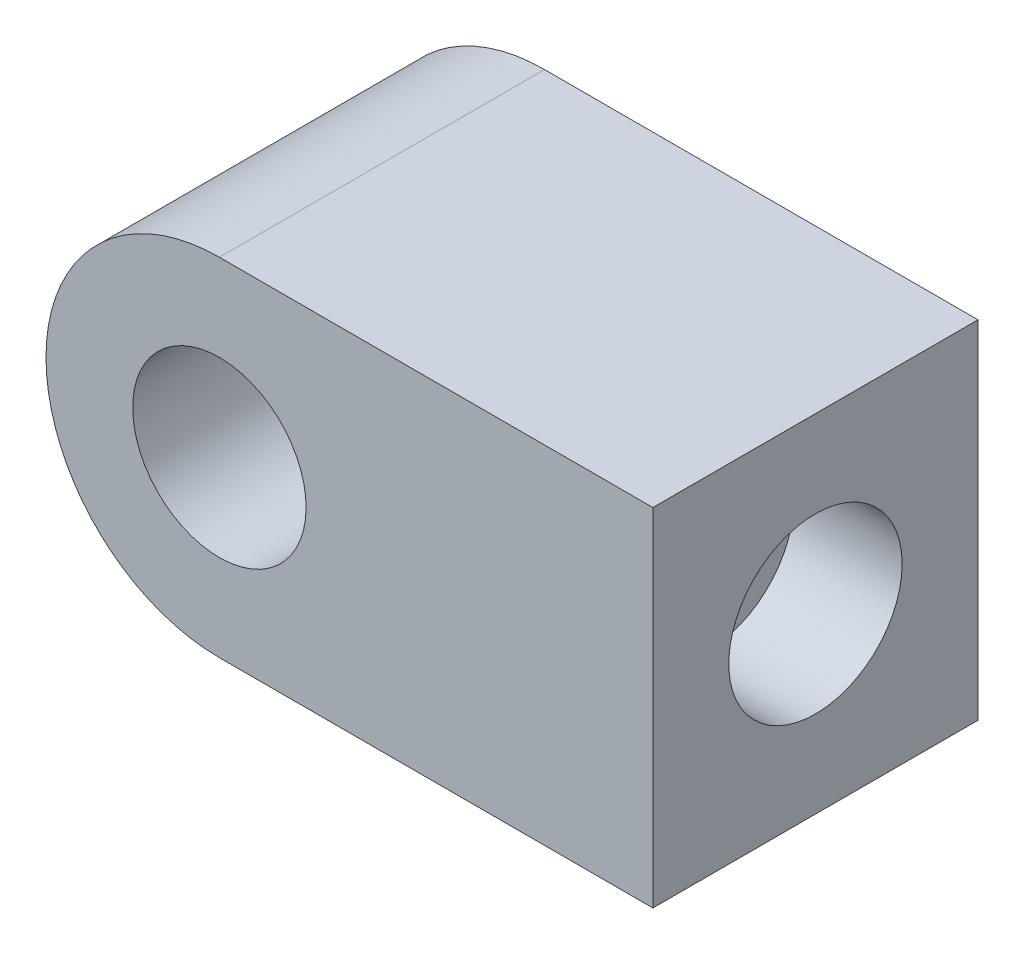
ISO-10303-21;
HEADER;
FILE_DESCRIPTION(('STEP AP214'),'2;1');
FILE_NAME('part.step','',(''),(''),'','','');
FILE_SCHEMA(('AUTOMOTIVE_DESIGN { 1 0 10303 214 1 1 1 1 }'));
ENDSEC;
DATA;
#1=APPLICATION_CONTEXT('core data for automotive mechanical design processes');
#2=APPLICATION_PROTOCOL_DEFINITION('international standard','automotive_design',2000,#1);
#3=PRODUCT_CONTEXT('',#1,'mechanical');
#4=PRODUCT('Part','Part','',(#3));
#5=PRODUCT_RELATED_PRODUCT_CATEGORY('part','',(#4));
#6=PRODUCT_DEFINITION_FORMATION('','',#4);
#7=PRODUCT_DEFINITION_CONTEXT('part definition',#1,'design');
#8=PRODUCT_DEFINITION('design','',#6,#7);
#9=PRODUCT_DEFINITION_SHAPE('','',#8);
#10=(LENGTH_UNIT() NAMED_UNIT(*) SI_UNIT(.MILLI.,.METRE.));
#11=(NAMED_UNIT(*) PLANE_ANGLE_UNIT() SI_UNIT($,.RADIAN.));
#12=(NAMED_UNIT(*) SI_UNIT($,.STERADIAN.) SOLID_ANGLE_UNIT());
#13=UNCERTAINTY_MEASURE_WITH_UNIT(LENGTH_MEASURE(1.E-05),#10,'distance_accuracy_value','');
#14=(GEOMETRIC_REPRESENTATION_CONTEXT(3) GLOBAL_UNCERTAINTY_ASSIGNED_CONTEXT((#13)) GLOBAL_UNIT_ASSIGNED_CONTEXT((#10,
#11,#12)) REPRESENTATION_CONTEXT('',''));
#15=CARTESIAN_POINT('',(0.,0.,0.));
#16=DIRECTION('',(0.,0.,1.));
#17=DIRECTION('',(1.,0.,0.));
#18=AXIS2_PLACEMENT_3D('',#15,#16,#17);
#19=CARTESIAN_POINT('',(0.,0.,15.));
#20=DIRECTION('',(0.,0.,1.));
#21=DIRECTION('',(1.,0.,0.));
#22=AXIS2_PLACEMENT_3D('',#19,#20,#21);
#23=PLANE('',#22);
#24=CARTESIAN_POINT('',(0.,0.,15.));
#25=DIRECTION('',(0.,0.,1.));
#26=DIRECTION('',(1.,0.,0.));
#27=AXIS2_PLACEMENT_3D('',#24,#25,#26);
#28=CIRCLE('',#27,8.);
#29=CARTESIAN_POINT('',(0.,8.,15.));
#30=VERTEX_POINT('',#29);
#31=CARTESIAN_POINT('',(0.,-8.,15.));
#32=VERTEX_POINT('',#31);
#33=EDGE_CURVE('E94',#30,#32,#28,.T.);
#34=ORIENTED_EDGE('',*,*,#33,.T.);
#35=DIRECTION('',(1.,0.,0.));
#36=VECTOR('',#35,1.);
#37=CARTESIAN_POINT('',(20.,-8.,15.));
#38=LINE('',#37,#36);
#39=CARTESIAN_POINT('',(20.,-8.,15.));
#40=VERTEX_POINT('',#39);
#41=EDGE_CURVE('E89',#32,#40,#38,.T.);
#42=ORIENTED_EDGE('',*,*,#41,.T.);
#43=DIRECTION('',(0.,1.,0.));
#44=VECTOR('',#43,1.);
#45=CARTESIAN_POINT('',(20.,8.,15.));
#46=LINE('',#45,#44);
#47=CARTESIAN_POINT('',(20.,8.,15.));
#48=VERTEX_POINT('',#47);
#49=EDGE_CURVE('E92',#40,#48,#46,.T.);
#50=ORIENTED_EDGE('',*,*,#49,.T.);
#51=DIRECTION('',(-1.,0.,0.));
#52=VECTOR('',#51,1.);
#53=CARTESIAN_POINT('',(0.,8.,15.));
#54=LINE('',#53,#52);
#55=EDGE_CURVE('E59',#48,#30,#54,.T.);
#56=ORIENTED_EDGE('',*,*,#55,.T.);
#57=EDGE_LOOP('',(#34,#42,#50,#56));
#58=FACE_BOUND('',#57,.T.);
#59=CARTESIAN_POINT('',(0.,0.,15.));
#60=DIRECTION('',(0.,0.,1.));
#61=DIRECTION('',(1.,0.,0.));
#62=AXIS2_PLACEMENT_3D('',#59,#60,#61);
#63=CIRCLE('',#62,4.);
#64=CARTESIAN_POINT('',(4.,0.,15.));
#65=VERTEX_POINT('',#64);
#66=EDGE_CURVE('E114',#65,#65,#63,.T.);
#67=ORIENTED_EDGE('',*,*,#66,.F.);
#68=EDGE_LOOP('',(#67));
#69=FACE_BOUND('',#68,.T.);
#70=ADVANCED_FACE('F41',(#58,#69),#23,.T.);
#71=CARTESIAN_POINT('',(0.,0.,0.));
#72=DIRECTION('',(0.,0.,1.));
#73=DIRECTION('',(1.,0.,0.));
#74=AXIS2_PLACEMENT_3D('',#71,#72,#73);
#75=PLANE('',#74);
#76=CARTESIAN_POINT('',(0.,0.,0.));
#77=DIRECTION('',(0.,0.,1.));
#78=DIRECTION('',(1.,0.,0.));
#79=AXIS2_PLACEMENT_3D('',#76,#77,#78);
#80=CIRCLE('',#79,8.);
#81=CARTESIAN_POINT('',(0.,8.,0.));
#82=VERTEX_POINT('',#81);
#83=CARTESIAN_POINT('',(0.,-8.,0.));
#84=VERTEX_POINT('',#83);
#85=EDGE_CURVE('E110',#82,#84,#80,.T.);
#86=ORIENTED_EDGE('',*,*,#85,.F.);
#87=DIRECTION('',(-1.,0.,0.));
#88=VECTOR('',#87,1.);
#89=CARTESIAN_POINT('',(0.,8.,0.));
#90=LINE('',#89,#88);
#91=CARTESIAN_POINT('',(20.,8.,0.));
#92=VERTEX_POINT('',#91);
#93=EDGE_CURVE('E82',#92,#82,#90,.T.);
#94=ORIENTED_EDGE('',*,*,#93,.F.);
#95=DIRECTION('',(0.,1.,0.));
#96=VECTOR('',#95,1.);
#97=CARTESIAN_POINT('',(20.,8.,0.));
#98=LINE('',#97,#96);
#99=CARTESIAN_POINT('',(20.,-8.,0.));
#100=VERTEX_POINT('',#99);
#101=EDGE_CURVE('E76',#100,#92,#98,.T.);
#102=ORIENTED_EDGE('',*,*,#101,.F.);
#103=DIRECTION('',(1.,0.,0.));
#104=VECTOR('',#103,1.);
#105=CARTESIAN_POINT('',(20.,-8.,0.));
#106=LINE('',#105,#104);
#107=EDGE_CURVE('E99',#84,#100,#106,.T.);
#108=ORIENTED_EDGE('',*,*,#107,.F.);
#109=EDGE_LOOP('',(#86,#94,#102,#108));
#110=FACE_BOUND('',#109,.T.);
#111=CARTESIAN_POINT('',(0.,0.,0.));
#112=DIRECTION('',(0.,0.,1.));
#113=DIRECTION('',(1.,0.,0.));
#114=AXIS2_PLACEMENT_3D('',#111,#112,#113);
#115=CIRCLE('',#114,4.);
#116=CARTESIAN_POINT('',(4.,0.,0.));
#117=VERTEX_POINT('',#116);
#118=EDGE_CURVE('E132',#117,#117,#115,.T.);
#119=ORIENTED_EDGE('',*,*,#118,.T.);
#120=EDGE_LOOP('',(#119));
#121=FACE_BOUND('',#120,.T.);
#122=ADVANCED_FACE('F127',(#110,#121),#75,.F.);
#123=CARTESIAN_POINT('',(0.,0.,15.));
#124=DIRECTION('',(0.,0.,-1.));
#125=DIRECTION('',(-1.,0.,0.));
#126=AXIS2_PLACEMENT_3D('',#123,#124,#125);
#127=CYLINDRICAL_SURFACE('',#126,8.);
#128=ORIENTED_EDGE('',*,*,#85,.T.);
#129=DIRECTION('',(0.,0.,-1.));
#130=VECTOR('',#129,1.);
#131=CARTESIAN_POINT('',(0.,-8.,15.));
#132=LINE('',#131,#130);
#133=EDGE_CURVE('E11',#32,#84,#132,.T.);
#134=ORIENTED_EDGE('',*,*,#133,.F.);
#135=ORIENTED_EDGE('',*,*,#33,.F.);
#136=DIRECTION('',(0.,0.,-1.));
#137=VECTOR('',#136,1.);
#138=CARTESIAN_POINT('',(0.,8.,15.));
#139=LINE('',#138,#137);
#140=EDGE_CURVE('E106',#30,#82,#139,.T.);
#141=ORIENTED_EDGE('',*,*,#140,.T.);
#142=EDGE_LOOP('',(#128,#134,#135,#141));
#143=FACE_BOUND('',#142,.T.);
#144=ADVANCED_FACE('F43',(#143),#127,.T.);
#145=CARTESIAN_POINT('',(20.,-8.,15.));
#146=DIRECTION('',(0.,1.,0.));
#147=DIRECTION('',(-1.,0.,0.));
#148=AXIS2_PLACEMENT_3D('',#145,#146,#147);
#149=PLANE('',#148);
#150=ORIENTED_EDGE('',*,*,#107,.T.);
#151=DIRECTION('',(0.,0.,-1.));
#152=VECTOR('',#151,1.);
#153=CARTESIAN_POINT('',(20.,-8.,15.));
#154=LINE('',#153,#152);
#155=EDGE_CURVE('E51',#40,#100,#154,.T.);
#156=ORIENTED_EDGE('',*,*,#155,.F.);
#157=ORIENTED_EDGE('',*,*,#41,.F.);
#158=ORIENTED_EDGE('',*,*,#133,.T.);
#159=EDGE_LOOP('',(#150,#156,#157,#158));
#160=FACE_BOUND('',#159,.T.);
#161=ADVANCED_FACE('F98',(#160),#149,.F.);
#162=CARTESIAN_POINT('',(20.,8.,15.));
#163=DIRECTION('',(-1.,0.,0.));
#164=DIRECTION('',(0.,-1.,0.));
#165=AXIS2_PLACEMENT_3D('',#162,#163,#164);
#166=PLANE('',#165);
#167=CARTESIAN_POINT('',(20.,0.,7.5));
#168=DIRECTION('',(1.,0.,0.));
#169=DIRECTION('',(0.,0.,-1.));
#170=AXIS2_PLACEMENT_3D('',#167,#168,#169);
#171=CIRCLE('',#170,4.);
#172=CARTESIAN_POINT('',(20.,0.,3.5));
#173=VERTEX_POINT('',#172);
#174=EDGE_CURVE('E140',#173,#173,#171,.T.);
#175=ORIENTED_EDGE('',*,*,#174,.F.);
#176=EDGE_LOOP('',(#175));
#177=FACE_BOUND('',#176,.T.);
#178=ORIENTED_EDGE('',*,*,#101,.T.);
#179=DIRECTION('',(0.,0.,-1.));
#180=VECTOR('',#179,1.);
#181=CARTESIAN_POINT('',(20.,8.,15.));
#182=LINE('',#181,#180);
#183=EDGE_CURVE('E101',#48,#92,#182,.T.);
#184=ORIENTED_EDGE('',*,*,#183,.F.);
#185=ORIENTED_EDGE('',*,*,#49,.F.);
#186=ORIENTED_EDGE('',*,*,#155,.T.);
#187=EDGE_LOOP('',(#178,#184,#185,#186));
#188=FACE_BOUND('',#187,.T.);
#189=ADVANCED_FACE('F102',(#177,#188),#166,.F.);
#190=CARTESIAN_POINT('',(0.,8.,15.));
#191=DIRECTION('',(0.,-1.,0.));
#192=DIRECTION('',(0.,0.,-1.));
#193=AXIS2_PLACEMENT_3D('',#190,#191,#192);
#194=PLANE('',#193);
#195=ORIENTED_EDGE('',*,*,#93,.T.);
#196=ORIENTED_EDGE('',*,*,#140,.F.);
#197=ORIENTED_EDGE('',*,*,#55,.F.);
#198=ORIENTED_EDGE('',*,*,#183,.T.);
#199=EDGE_LOOP('',(#195,#196,#197,#198));
#200=FACE_BOUND('',#199,.T.);
#201=ADVANCED_FACE('F124',(#200),#194,.F.);
#202=CARTESIAN_POINT('',(0.,0.,15.));
#203=DIRECTION('',(0.,0.,-1.));
#204=DIRECTION('',(-1.,0.,0.));
#205=AXIS2_PLACEMENT_3D('',#202,#203,#204);
#206=CYLINDRICAL_SURFACE('',#205,4.);
#207=ORIENTED_EDGE('',*,*,#66,.T.);
#208=EDGE_LOOP('',(#207));
#209=FACE_BOUND('',#208,.T.);
#210=ORIENTED_EDGE('',*,*,#118,.F.);
#211=EDGE_LOOP('',(#210));
#212=FACE_BOUND('',#211,.T.);
#213=ADVANCED_FACE('F153',(#209,#212),#206,.F.);
#214=CARTESIAN_POINT('',(15.,0.,7.5));
#215=DIRECTION('',(1.,0.,0.));
#216=DIRECTION('',(0.,0.,-1.));
#217=AXIS2_PLACEMENT_3D('',#214,#215,#216);
#218=CYLINDRICAL_SURFACE('',#217,4.);
#219=CARTESIAN_POINT('',(15.,0.,7.5));
#220=DIRECTION('',(1.,0.,0.));
#221=DIRECTION('',(0.,0.,-1.));
#222=AXIS2_PLACEMENT_3D('',#219,#220,#221);
#223=CIRCLE('',#222,4.);
#224=CARTESIAN_POINT('',(15.,0.,3.5));
#225=VERTEX_POINT('',#224);
#226=EDGE_CURVE('E136',#225,#225,#223,.T.);
#227=ORIENTED_EDGE('',*,*,#226,.F.);
#228=EDGE_LOOP('',(#227));
#229=FACE_BOUND('',#228,.T.);
#230=ORIENTED_EDGE('',*,*,#174,.T.);
#231=EDGE_LOOP('',(#230));
#232=FACE_BOUND('',#231,.T.);
#233=ADVANCED_FACE('F150',(#229,#232),#218,.F.);
#234=CARTESIAN_POINT('',(15.,0.,7.5));
#235=DIRECTION('',(1.,0.,0.));
#236=DIRECTION('',(0.,0.,-1.));
#237=AXIS2_PLACEMENT_3D('',#234,#235,#236);
#238=PLANE('',#237);
#239=ORIENTED_EDGE('',*,*,#226,.T.);
#240=EDGE_LOOP('',(#239));
#241=FACE_BOUND('',#240,.T.);
#242=ADVANCED_FACE('F148',(#241),#238,.T.);
#243=CLOSED_SHELL('',(#70,#122,#144,#161,#189,#201,#213,#233,#242));
#244=MANIFOLD_SOLID_BREP('B2',#243);
#245=ADVANCED_BREP_SHAPE_REPRESENTATION('',(#18,#244),#14);
#246=SHAPE_DEFINITION_REPRESENTATION(#9,#245);
ENDSEC;
END-ISO-10303-21;
